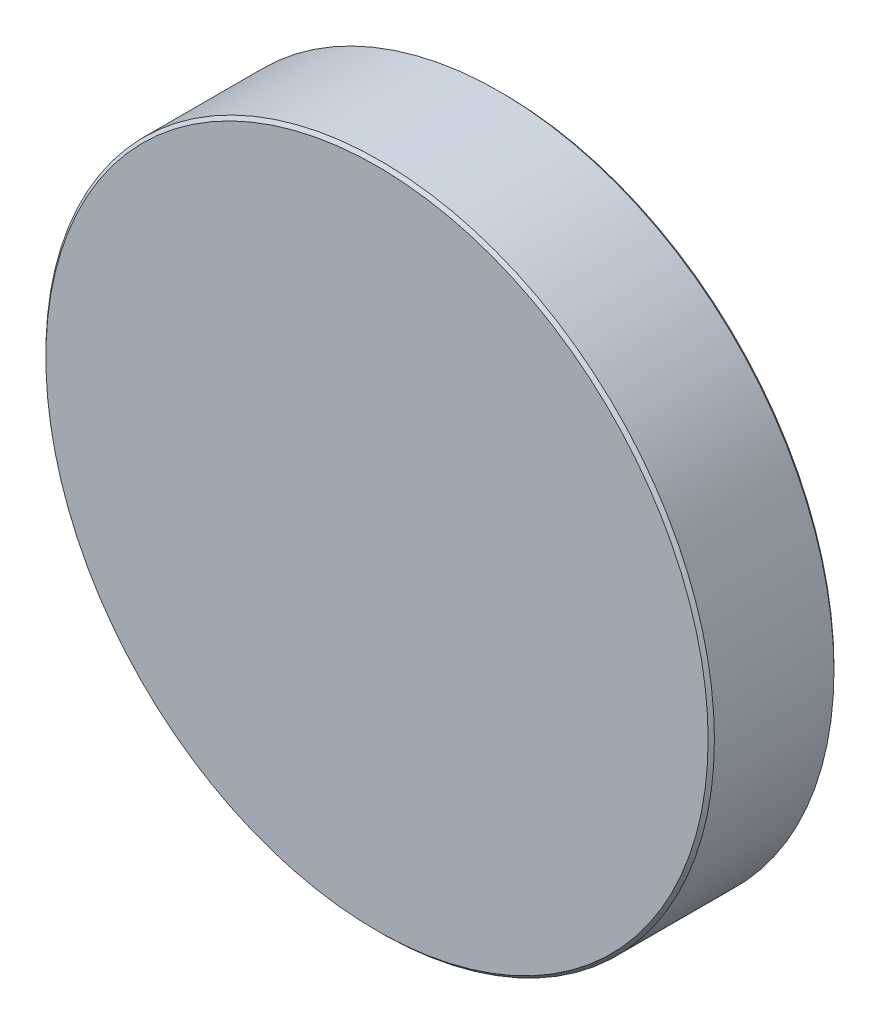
ISO-10303-21;
HEADER;
FILE_DESCRIPTION(('STEP AP214'),'2;1');
FILE_NAME('part.step','',(''),(''),'','','');
FILE_SCHEMA(('AUTOMOTIVE_DESIGN { 1 0 10303 214 1 1 1 1 }'));
ENDSEC;
DATA;
#1=APPLICATION_CONTEXT('core data for automotive mechanical design processes');
#2=APPLICATION_PROTOCOL_DEFINITION('international standard','automotive_design',2000,#1);
#3=PRODUCT_CONTEXT('',#1,'mechanical');
#4=PRODUCT('Part','Part','',(#3));
#5=PRODUCT_RELATED_PRODUCT_CATEGORY('part','',(#4));
#6=PRODUCT_DEFINITION_FORMATION('','',#4);
#7=PRODUCT_DEFINITION_CONTEXT('part definition',#1,'design');
#8=PRODUCT_DEFINITION('design','',#6,#7);
#9=PRODUCT_DEFINITION_SHAPE('','',#8);
#10=(LENGTH_UNIT() NAMED_UNIT(*) SI_UNIT(.MILLI.,.METRE.));
#11=(NAMED_UNIT(*) PLANE_ANGLE_UNIT() SI_UNIT($,.RADIAN.));
#12=(NAMED_UNIT(*) SI_UNIT($,.STERADIAN.) SOLID_ANGLE_UNIT());
#13=UNCERTAINTY_MEASURE_WITH_UNIT(LENGTH_MEASURE(1.E-05),#10,'distance_accuracy_value','');
#14=(GEOMETRIC_REPRESENTATION_CONTEXT(3) GLOBAL_UNCERTAINTY_ASSIGNED_CONTEXT((#13)) GLOBAL_UNIT_ASSIGNED_CONTEXT((#10,
#11,#12)) REPRESENTATION_CONTEXT('',''));
#15=CARTESIAN_POINT('',(0.,0.,0.));
#16=DIRECTION('',(0.,0.,1.));
#17=DIRECTION('',(1.,0.,0.));
#18=AXIS2_PLACEMENT_3D('',#15,#16,#17);
#19=CARTESIAN_POINT('',(0.,0.,10.16));
#20=DIRECTION('',(0.,0.,-1.));
#21=DIRECTION('',(-1.,0.,0.));
#22=AXIS2_PLACEMENT_3D('',#19,#20,#21);
#23=CYLINDRICAL_SURFACE('',#22,26.9875);
#24=CARTESIAN_POINT('',(0.,0.,0.254000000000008));
#25=DIRECTION('',(0.,0.,1.));
#26=DIRECTION('',(1.,0.,0.));
#27=AXIS2_PLACEMENT_3D('',#24,#25,#26);
#28=CIRCLE('',#27,26.9875);
#29=CARTESIAN_POINT('',(26.9875,0.,0.254000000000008));
#30=VERTEX_POINT('',#29);
#31=EDGE_CURVE('E99',#30,#30,#28,.T.);
#32=ORIENTED_EDGE('',*,*,#31,.T.);
#33=EDGE_LOOP('',(#32));
#34=FACE_BOUND('',#33,.T.);
#35=CARTESIAN_POINT('',(0.,0.,9.90600000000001));
#36=DIRECTION('',(0.,0.,1.));
#37=DIRECTION('',(1.,0.,0.));
#38=AXIS2_PLACEMENT_3D('',#35,#36,#37);
#39=CIRCLE('',#38,26.9875);
#40=CARTESIAN_POINT('',(26.9875,0.,9.90600000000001));
#41=VERTEX_POINT('',#40);
#42=EDGE_CURVE('E103',#41,#41,#39,.F.);
#43=ORIENTED_EDGE('',*,*,#42,.T.);
#44=EDGE_LOOP('',(#43));
#45=FACE_BOUND('',#44,.T.);
#46=ADVANCED_FACE('F88',(#34,#45),#23,.T.);
#47=CARTESIAN_POINT('',(0.,0.,10.16));
#48=DIRECTION('',(0.,0.,1.));
#49=DIRECTION('',(1.,0.,0.));
#50=AXIS2_PLACEMENT_3D('',#47,#48,#49);
#51=PLANE('',#50);
#52=CARTESIAN_POINT('',(0.,0.,10.16));
#53=DIRECTION('',(0.,0.,1.));
#54=DIRECTION('',(1.,0.,0.));
#55=AXIS2_PLACEMENT_3D('',#52,#53,#54);
#56=CIRCLE('',#55,26.7335);
#57=CARTESIAN_POINT('',(26.7335,0.,10.16));
#58=VERTEX_POINT('',#57);
#59=EDGE_CURVE('E11',#58,#58,#56,.T.);
#60=ORIENTED_EDGE('',*,*,#59,.T.);
#61=EDGE_LOOP('',(#60));
#62=FACE_BOUND('',#61,.T.);
#63=ADVANCED_FACE('F119',(#62),#51,.T.);
#64=CARTESIAN_POINT('',(0.,0.,0.));
#65=DIRECTION('',(0.,0.,1.));
#66=DIRECTION('',(1.,0.,0.));
#67=AXIS2_PLACEMENT_3D('',#64,#65,#66);
#68=PLANE('',#67);
#69=CARTESIAN_POINT('',(0.,0.,0.));
#70=DIRECTION('',(0.,0.,1.));
#71=DIRECTION('',(1.,0.,0.));
#72=AXIS2_PLACEMENT_3D('',#69,#70,#71);
#73=CIRCLE('',#72,26.7335);
#74=CARTESIAN_POINT('',(26.7335,0.,0.));
#75=VERTEX_POINT('',#74);
#76=EDGE_CURVE('E95',#75,#75,#73,.F.);
#77=ORIENTED_EDGE('',*,*,#76,.T.);
#78=EDGE_LOOP('',(#77));
#79=FACE_BOUND('',#78,.T.);
#80=ADVANCED_FACE('F116',(#79),#68,.F.);
#81=CARTESIAN_POINT('',(0.,0.,0.254000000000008));
#82=DIRECTION('',(0.,0.,1.));
#83=DIRECTION('',(1.,0.,0.));
#84=AXIS2_PLACEMENT_3D('',#81,#82,#83);
#85=CONICAL_SURFACE('',#84,26.9875,0.785398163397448);
#86=ORIENTED_EDGE('',*,*,#76,.F.);
#87=EDGE_LOOP('',(#86));
#88=FACE_BOUND('',#87,.T.);
#89=ORIENTED_EDGE('',*,*,#31,.F.);
#90=EDGE_LOOP('',(#89));
#91=FACE_BOUND('',#90,.T.);
#92=ADVANCED_FACE('F112',(#88,#91),#85,.T.);
#93=CARTESIAN_POINT('',(0.,0.,10.16));
#94=DIRECTION('',(0.,0.,-1.));
#95=DIRECTION('',(-1.,0.,0.));
#96=AXIS2_PLACEMENT_3D('',#93,#94,#95);
#97=CONICAL_SURFACE('',#96,26.7335,0.785398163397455);
#98=ORIENTED_EDGE('',*,*,#42,.F.);
#99=EDGE_LOOP('',(#98));
#100=FACE_BOUND('',#99,.T.);
#101=ORIENTED_EDGE('',*,*,#59,.F.);
#102=EDGE_LOOP('',(#101));
#103=FACE_BOUND('',#102,.T.);
#104=ADVANCED_FACE('F90',(#100,#103),#97,.T.);
#105=CLOSED_SHELL('',(#46,#63,#80,#92,#104));
#106=MANIFOLD_SOLID_BREP('B2',#105);
#107=ADVANCED_BREP_SHAPE_REPRESENTATION('',(#18,#106),#14);
#108=SHAPE_DEFINITION_REPRESENTATION(#9,#107);
ENDSEC;
END-ISO-10303-21;
